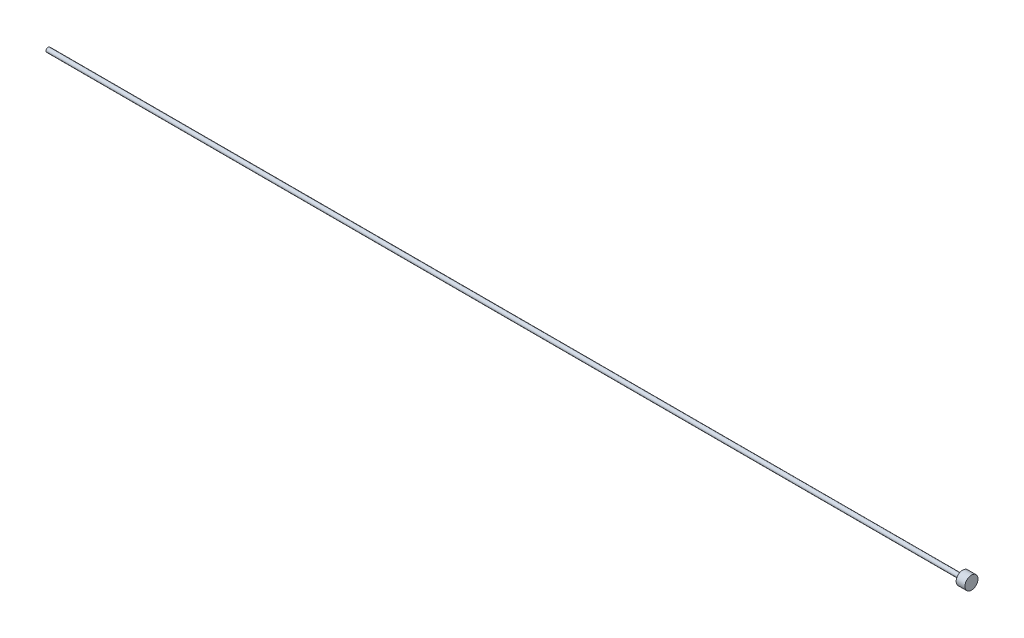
ISO-10303-21;
HEADER;
FILE_DESCRIPTION(('STEP AP214'),'2;1');
FILE_NAME('part.step','',(''),(''),'','','');
FILE_SCHEMA(('AUTOMOTIVE_DESIGN { 1 0 10303 214 1 1 1 1 }'));
ENDSEC;
DATA;
#1=APPLICATION_CONTEXT('core data for automotive mechanical design processes');
#2=APPLICATION_PROTOCOL_DEFINITION('international standard','automotive_design',2000,#1);
#3=PRODUCT_CONTEXT('',#1,'mechanical');
#4=PRODUCT('Part','Part','',(#3));
#5=PRODUCT_RELATED_PRODUCT_CATEGORY('part','',(#4));
#6=PRODUCT_DEFINITION_FORMATION('','',#4);
#7=PRODUCT_DEFINITION_CONTEXT('part definition',#1,'design');
#8=PRODUCT_DEFINITION('design','',#6,#7);
#9=PRODUCT_DEFINITION_SHAPE('','',#8);
#10=(LENGTH_UNIT() NAMED_UNIT(*) SI_UNIT(.MILLI.,.METRE.));
#11=(NAMED_UNIT(*) PLANE_ANGLE_UNIT() SI_UNIT($,.RADIAN.));
#12=(NAMED_UNIT(*) SI_UNIT($,.STERADIAN.) SOLID_ANGLE_UNIT());
#13=UNCERTAINTY_MEASURE_WITH_UNIT(LENGTH_MEASURE(1.E-05),#10,'distance_accuracy_value','');
#14=(GEOMETRIC_REPRESENTATION_CONTEXT(3) GLOBAL_UNCERTAINTY_ASSIGNED_CONTEXT((#13)) GLOBAL_UNIT_ASSIGNED_CONTEXT((#10,
#11,#12)) REPRESENTATION_CONTEXT('',''));
#15=CARTESIAN_POINT('',(0.,0.,0.));
#16=DIRECTION('',(0.,0.,1.));
#17=DIRECTION('',(1.,0.,0.));
#18=AXIS2_PLACEMENT_3D('',#15,#16,#17);
#19=CARTESIAN_POINT('',(294.909595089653,0.,0.));
#20=DIRECTION('',(1.,0.,0.));
#21=DIRECTION('',(0.,0.,-1.));
#22=AXIS2_PLACEMENT_3D('',#19,#20,#21);
#23=CYLINDRICAL_SURFACE('',#22,3.175);
#24=CARTESIAN_POINT('',(304.397851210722,0.,0.));
#25=DIRECTION('',(-1.,0.,0.));
#26=DIRECTION('',(0.,0.,1.));
#27=AXIS2_PLACEMENT_3D('',#24,#25,#26);
#28=CIRCLE('',#27,3.175);
#29=CARTESIAN_POINT('',(304.397851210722,0.,3.175));
#30=VERTEX_POINT('',#29);
#31=EDGE_CURVE('E10',#30,#30,#28,.F.);
#32=ORIENTED_EDGE('',*,*,#31,.T.);
#33=EDGE_LOOP('',(#32));
#34=FACE_BOUND('',#33,.T.);
#35=CARTESIAN_POINT('',(1631.48435121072,0.,0.));
#36=DIRECTION('',(-1.,0.,0.));
#37=DIRECTION('',(0.,0.,1.));
#38=AXIS2_PLACEMENT_3D('',#35,#36,#37);
#39=CIRCLE('',#38,3.175);
#40=CARTESIAN_POINT('',(1631.48435121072,0.,3.175));
#41=VERTEX_POINT('',#40);
#42=EDGE_CURVE('E42',#41,#41,#39,.T.);
#43=ORIENTED_EDGE('',*,*,#42,.T.);
#44=EDGE_LOOP('',(#43));
#45=FACE_BOUND('',#44,.T.);
#46=ADVANCED_FACE('F31',(#34,#45),#23,.T.);
#47=CARTESIAN_POINT('',(303.889851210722,0.,0.));
#48=DIRECTION('',(-1.,0.,0.));
#49=DIRECTION('',(0.,0.,1.));
#50=AXIS2_PLACEMENT_3D('',#47,#48,#49);
#51=PLANE('',#50);
#52=CARTESIAN_POINT('',(303.889851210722,0.,0.));
#53=DIRECTION('',(-1.,0.,0.));
#54=DIRECTION('',(0.,0.,1.));
#55=AXIS2_PLACEMENT_3D('',#52,#53,#54);
#56=CIRCLE('',#55,2.66699999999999);
#57=CARTESIAN_POINT('',(303.889851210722,0.,2.66699999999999));
#58=VERTEX_POINT('',#57);
#59=EDGE_CURVE('E38',#58,#58,#56,.T.);
#60=ORIENTED_EDGE('',*,*,#59,.T.);
#61=EDGE_LOOP('',(#60));
#62=FACE_BOUND('',#61,.T.);
#63=ADVANCED_FACE('F73',(#62),#51,.T.);
#64=CARTESIAN_POINT('',(1631.48435121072,0.,0.));
#65=DIRECTION('',(-1.,0.,0.));
#66=DIRECTION('',(0.,0.,1.));
#67=AXIS2_PLACEMENT_3D('',#64,#65,#66);
#68=PLANE('',#67);
#69=CARTESIAN_POINT('',(1631.48435121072,0.,0.));
#70=DIRECTION('',(-1.,0.,0.));
#71=DIRECTION('',(0.,0.,1.));
#72=AXIS2_PLACEMENT_3D('',#69,#70,#71);
#73=CIRCLE('',#72,9.52500000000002);
#74=CARTESIAN_POINT('',(1631.48435121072,0.,9.52500000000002));
#75=VERTEX_POINT('',#74);
#76=EDGE_CURVE('E46',#75,#75,#73,.T.);
#77=ORIENTED_EDGE('',*,*,#76,.T.);
#78=EDGE_LOOP('',(#77));
#79=FACE_BOUND('',#78,.T.);
#80=ORIENTED_EDGE('',*,*,#42,.F.);
#81=EDGE_LOOP('',(#80));
#82=FACE_BOUND('',#81,.T.);
#83=ADVANCED_FACE('F55',(#79,#82),#68,.T.);
#84=CARTESIAN_POINT('',(1631.48435121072,0.,0.));
#85=DIRECTION('',(1.,0.,0.));
#86=DIRECTION('',(0.,0.,-1.));
#87=AXIS2_PLACEMENT_3D('',#84,#85,#86);
#88=CYLINDRICAL_SURFACE('',#87,9.52500000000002);
#89=ORIENTED_EDGE('',*,*,#76,.F.);
#90=EDGE_LOOP('',(#89));
#91=FACE_BOUND('',#90,.T.);
#92=CARTESIAN_POINT('',(1644.18435121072,0.,0.));
#93=DIRECTION('',(-1.,0.,0.));
#94=DIRECTION('',(0.,0.,1.));
#95=AXIS2_PLACEMENT_3D('',#92,#93,#94);
#96=CIRCLE('',#95,9.52500000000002);
#97=CARTESIAN_POINT('',(1644.18435121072,0.,9.52500000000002));
#98=VERTEX_POINT('',#97);
#99=EDGE_CURVE('E49',#98,#98,#96,.T.);
#100=ORIENTED_EDGE('',*,*,#99,.T.);
#101=EDGE_LOOP('',(#100));
#102=FACE_BOUND('',#101,.T.);
#103=ADVANCED_FACE('F58',(#91,#102),#88,.T.);
#104=CARTESIAN_POINT('',(1644.18435121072,0.,0.));
#105=DIRECTION('',(-1.,0.,0.));
#106=DIRECTION('',(0.,0.,1.));
#107=AXIS2_PLACEMENT_3D('',#104,#105,#106);
#108=PLANE('',#107);
#109=ORIENTED_EDGE('',*,*,#99,.F.);
#110=EDGE_LOOP('',(#109));
#111=FACE_BOUND('',#110,.T.);
#112=ADVANCED_FACE('F61',(#111),#108,.F.);
#113=CARTESIAN_POINT('',(303.889851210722,0.,0.));
#114=DIRECTION('',(1.,0.,0.));
#115=DIRECTION('',(0.,0.,-1.));
#116=AXIS2_PLACEMENT_3D('',#113,#114,#115);
#117=CONICAL_SURFACE('',#116,2.66699999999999,0.785398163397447);
#118=ORIENTED_EDGE('',*,*,#31,.F.);
#119=EDGE_LOOP('',(#118));
#120=FACE_BOUND('',#119,.T.);
#121=ORIENTED_EDGE('',*,*,#59,.F.);
#122=EDGE_LOOP('',(#121));
#123=FACE_BOUND('',#122,.T.);
#124=ADVANCED_FACE('F33',(#120,#123),#117,.T.);
#125=CLOSED_SHELL('',(#46,#63,#83,#103,#112,#124));
#126=MANIFOLD_SOLID_BREP('B2',#125);
#127=ADVANCED_BREP_SHAPE_REPRESENTATION('',(#18,#126),#14);
#128=SHAPE_DEFINITION_REPRESENTATION(#9,#127);
ENDSEC;
END-ISO-10303-21;
